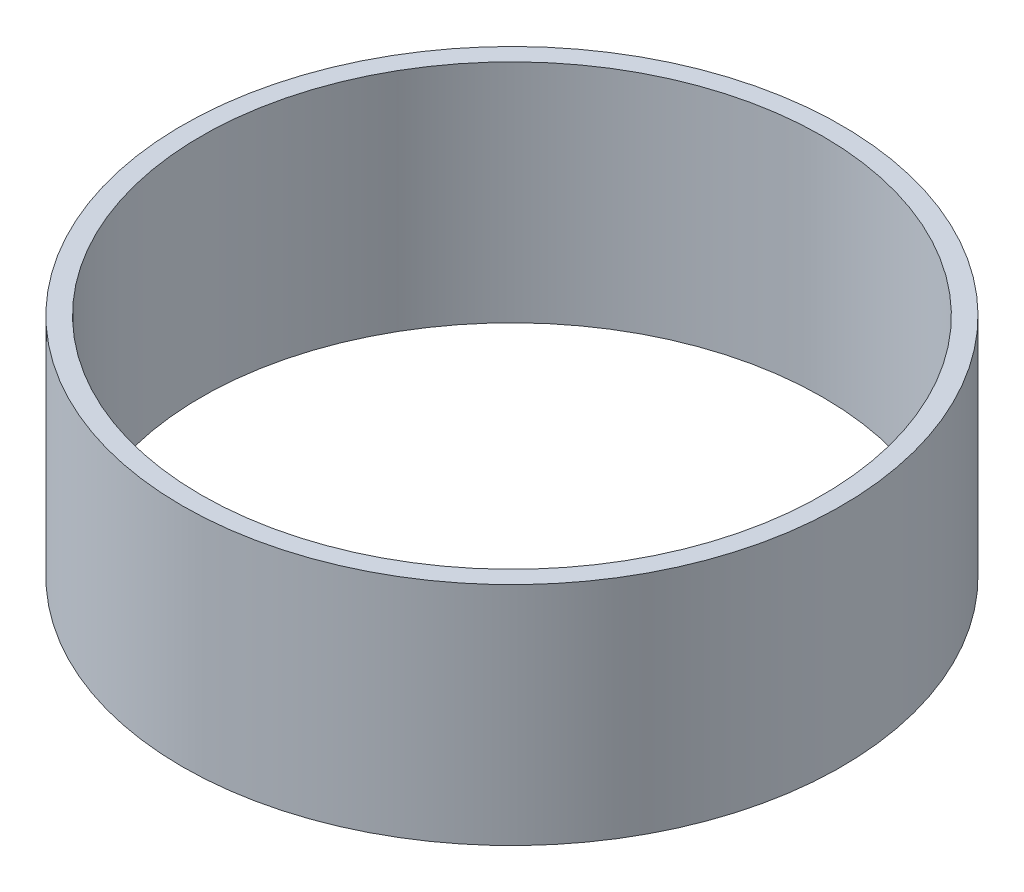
from build123d import *

# Parameters (mm, degrees)
SKETCH1_R           = 17.5
SKETCH1_R_2         = 16.5
BOSS_EXTRUDE1_DEPTH = 12


with BuildPart() as part:
    # Sketch1 → Boss-Extrude1 (new body)
    with BuildSketch(Plane(origin=(0, 0, 0), x_dir=(1, 0, 0), z_dir=(0, 1, 0))):
        with Locations(Location((0, 0, 0), (0, 0, 270))):
            Circle(SKETCH1_R)
        with Locations(Location((0, 0, 0), (0, 0, 270))):
            Circle(SKETCH1_R_2, mode=Mode.SUBTRACT)
    extrude(amount=BOSS_EXTRUDE1_DEPTH)


solid = part.part
